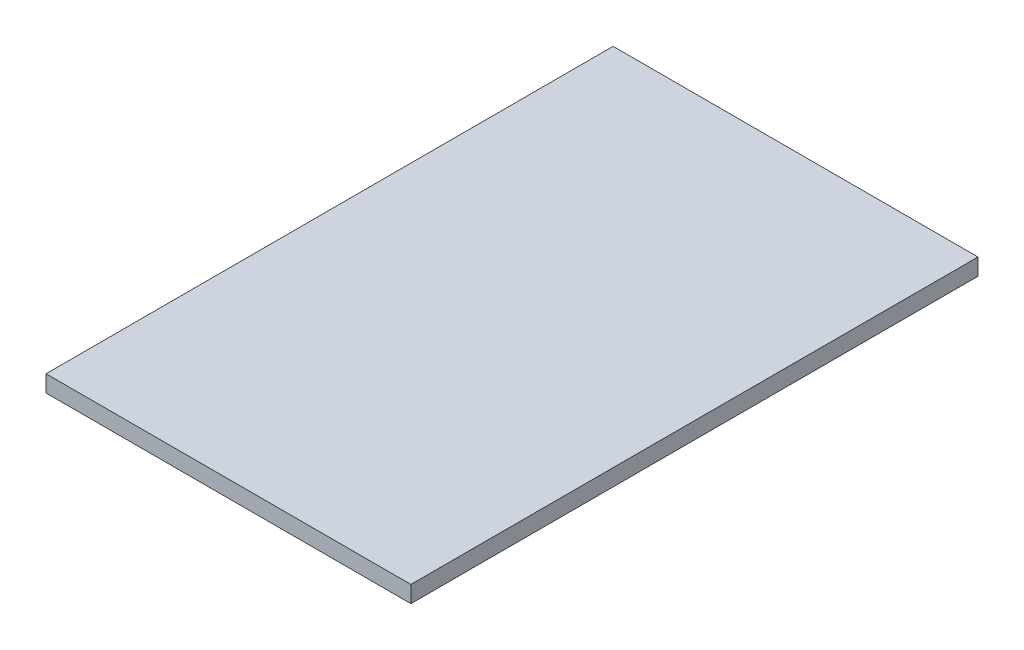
ISO-10303-21;
HEADER;
FILE_DESCRIPTION(('STEP AP214'),'2;1');
FILE_NAME('part.step','',(''),(''),'','','');
FILE_SCHEMA(('AUTOMOTIVE_DESIGN { 1 0 10303 214 1 1 1 1 }'));
ENDSEC;
DATA;
#1=APPLICATION_CONTEXT('core data for automotive mechanical design processes');
#2=APPLICATION_PROTOCOL_DEFINITION('international standard','automotive_design',2000,#1);
#3=PRODUCT_CONTEXT('',#1,'mechanical');
#4=PRODUCT('Part','Part','',(#3));
#5=PRODUCT_RELATED_PRODUCT_CATEGORY('part','',(#4));
#6=PRODUCT_DEFINITION_FORMATION('','',#4);
#7=PRODUCT_DEFINITION_CONTEXT('part definition',#1,'design');
#8=PRODUCT_DEFINITION('design','',#6,#7);
#9=PRODUCT_DEFINITION_SHAPE('','',#8);
#10=(LENGTH_UNIT() NAMED_UNIT(*) SI_UNIT(.MILLI.,.METRE.));
#11=(NAMED_UNIT(*) PLANE_ANGLE_UNIT() SI_UNIT($,.RADIAN.));
#12=(NAMED_UNIT(*) SI_UNIT($,.STERADIAN.) SOLID_ANGLE_UNIT());
#13=UNCERTAINTY_MEASURE_WITH_UNIT(LENGTH_MEASURE(1.E-05),#10,'distance_accuracy_value','');
#14=(GEOMETRIC_REPRESENTATION_CONTEXT(3) GLOBAL_UNCERTAINTY_ASSIGNED_CONTEXT((#13)) GLOBAL_UNIT_ASSIGNED_CONTEXT((#10,
#11,#12)) REPRESENTATION_CONTEXT('',''));
#15=CARTESIAN_POINT('',(0.,0.,0.));
#16=DIRECTION('',(0.,0.,1.));
#17=DIRECTION('',(1.,0.,0.));
#18=AXIS2_PLACEMENT_3D('',#15,#16,#17);
#19=CARTESIAN_POINT('',(0.,0.8,0.));
#20=DIRECTION('',(1.,0.,0.));
#21=DIRECTION('',(0.,0.,-1.));
#22=AXIS2_PLACEMENT_3D('',#19,#20,#21);
#23=PLANE('',#22);
#24=DIRECTION('',(0.,0.,1.));
#25=VECTOR('',#24,1.);
#26=CARTESIAN_POINT('',(0.,0.,0.));
#27=LINE('',#26,#25);
#28=CARTESIAN_POINT('',(0.,0.,-27.2));
#29=VERTEX_POINT('',#28);
#30=CARTESIAN_POINT('',(0.,0.,0.));
#31=VERTEX_POINT('',#30);
#32=EDGE_CURVE('E102',#29,#31,#27,.T.);
#33=ORIENTED_EDGE('',*,*,#32,.T.);
#34=DIRECTION('',(0.,-1.,0.));
#35=VECTOR('',#34,1.);
#36=CARTESIAN_POINT('',(0.,0.8,0.));
#37=LINE('',#36,#35);
#38=CARTESIAN_POINT('',(0.,0.8,0.));
#39=VERTEX_POINT('',#38);
#40=EDGE_CURVE('E11',#39,#31,#37,.T.);
#41=ORIENTED_EDGE('',*,*,#40,.F.);
#42=DIRECTION('',(0.,0.,1.));
#43=VECTOR('',#42,1.);
#44=CARTESIAN_POINT('',(0.,0.8,0.));
#45=LINE('',#44,#43);
#46=CARTESIAN_POINT('',(0.,0.8,-27.2));
#47=VERTEX_POINT('',#46);
#48=EDGE_CURVE('E90',#47,#39,#45,.T.);
#49=ORIENTED_EDGE('',*,*,#48,.F.);
#50=DIRECTION('',(0.,-1.,0.));
#51=VECTOR('',#50,1.);
#52=CARTESIAN_POINT('',(0.,0.8,-27.2));
#53=LINE('',#52,#51);
#54=EDGE_CURVE('E98',#47,#29,#53,.T.);
#55=ORIENTED_EDGE('',*,*,#54,.T.);
#56=EDGE_LOOP('',(#33,#41,#49,#55));
#57=FACE_BOUND('',#56,.T.);
#58=ADVANCED_FACE('F39',(#57),#23,.F.);
#59=CARTESIAN_POINT('',(0.,0.8,0.));
#60=DIRECTION('',(0.,0.,-1.));
#61=DIRECTION('',(-1.,0.,0.));
#62=AXIS2_PLACEMENT_3D('',#59,#60,#61);
#63=PLANE('',#62);
#64=DIRECTION('',(1.,0.,0.));
#65=VECTOR('',#64,1.);
#66=CARTESIAN_POINT('',(0.,0.,0.));
#67=LINE('',#66,#65);
#68=CARTESIAN_POINT('',(17.5,0.,0.));
#69=VERTEX_POINT('',#68);
#70=EDGE_CURVE('E94',#31,#69,#67,.T.);
#71=ORIENTED_EDGE('',*,*,#70,.T.);
#72=DIRECTION('',(0.,-1.,0.));
#73=VECTOR('',#72,1.);
#74=CARTESIAN_POINT('',(17.5,0.8,0.));
#75=LINE('',#74,#73);
#76=CARTESIAN_POINT('',(17.5,0.8,0.));
#77=VERTEX_POINT('',#76);
#78=EDGE_CURVE('E47',#77,#69,#75,.T.);
#79=ORIENTED_EDGE('',*,*,#78,.F.);
#80=DIRECTION('',(1.,0.,0.));
#81=VECTOR('',#80,1.);
#82=CARTESIAN_POINT('',(0.,0.8,0.));
#83=LINE('',#82,#81);
#84=EDGE_CURVE('E85',#39,#77,#83,.T.);
#85=ORIENTED_EDGE('',*,*,#84,.F.);
#86=ORIENTED_EDGE('',*,*,#40,.T.);
#87=EDGE_LOOP('',(#71,#79,#85,#86));
#88=FACE_BOUND('',#87,.T.);
#89=ADVANCED_FACE('F93',(#88),#63,.F.);
#90=CARTESIAN_POINT('',(17.5,0.8,0.));
#91=DIRECTION('',(-1.,0.,0.));
#92=DIRECTION('',(0.,0.,1.));
#93=AXIS2_PLACEMENT_3D('',#90,#91,#92);
#94=PLANE('',#93);
#95=DIRECTION('',(0.,0.,-1.));
#96=VECTOR('',#95,1.);
#97=CARTESIAN_POINT('',(17.5,0.,0.));
#98=LINE('',#97,#96);
#99=CARTESIAN_POINT('',(17.5,0.,-27.2));
#100=VERTEX_POINT('',#99);
#101=EDGE_CURVE('E72',#69,#100,#98,.T.);
#102=ORIENTED_EDGE('',*,*,#101,.T.);
#103=DIRECTION('',(0.,-1.,0.));
#104=VECTOR('',#103,1.);
#105=CARTESIAN_POINT('',(17.5,0.8,-27.2));
#106=LINE('',#105,#104);
#107=CARTESIAN_POINT('',(17.5,0.8,-27.2));
#108=VERTEX_POINT('',#107);
#109=EDGE_CURVE('E95',#108,#100,#106,.T.);
#110=ORIENTED_EDGE('',*,*,#109,.F.);
#111=DIRECTION('',(0.,0.,-1.));
#112=VECTOR('',#111,1.);
#113=CARTESIAN_POINT('',(17.5,0.8,0.));
#114=LINE('',#113,#112);
#115=EDGE_CURVE('E88',#77,#108,#114,.T.);
#116=ORIENTED_EDGE('',*,*,#115,.F.);
#117=ORIENTED_EDGE('',*,*,#78,.T.);
#118=EDGE_LOOP('',(#102,#110,#116,#117));
#119=FACE_BOUND('',#118,.T.);
#120=ADVANCED_FACE('F96',(#119),#94,.F.);
#121=CARTESIAN_POINT('',(0.,0.8,-27.2));
#122=DIRECTION('',(0.,0.,1.));
#123=DIRECTION('',(1.,0.,0.));
#124=AXIS2_PLACEMENT_3D('',#121,#122,#123);
#125=PLANE('',#124);
#126=DIRECTION('',(-1.,0.,0.));
#127=VECTOR('',#126,1.);
#128=CARTESIAN_POINT('',(0.,0.,-27.2));
#129=LINE('',#128,#127);
#130=EDGE_CURVE('E78',#100,#29,#129,.T.);
#131=ORIENTED_EDGE('',*,*,#130,.T.);
#132=ORIENTED_EDGE('',*,*,#54,.F.);
#133=DIRECTION('',(-1.,0.,0.));
#134=VECTOR('',#133,1.);
#135=CARTESIAN_POINT('',(0.,0.8,-27.2));
#136=LINE('',#135,#134);
#137=EDGE_CURVE('E55',#108,#47,#136,.T.);
#138=ORIENTED_EDGE('',*,*,#137,.F.);
#139=ORIENTED_EDGE('',*,*,#109,.T.);
#140=EDGE_LOOP('',(#131,#132,#138,#139));
#141=FACE_BOUND('',#140,.T.);
#142=ADVANCED_FACE('F109',(#141),#125,.F.);
#143=CARTESIAN_POINT('',(0.,0.8,0.));
#144=DIRECTION('',(0.,-1.,0.));
#145=DIRECTION('',(0.,0.,-1.));
#146=AXIS2_PLACEMENT_3D('',#143,#144,#145);
#147=PLANE('',#146);
#148=ORIENTED_EDGE('',*,*,#48,.T.);
#149=ORIENTED_EDGE('',*,*,#84,.T.);
#150=ORIENTED_EDGE('',*,*,#115,.T.);
#151=ORIENTED_EDGE('',*,*,#137,.T.);
#152=EDGE_LOOP('',(#148,#149,#150,#151));
#153=FACE_BOUND('',#152,.T.);
#154=ADVANCED_FACE('F86',(#153),#147,.F.);
#155=CARTESIAN_POINT('',(0.,0.,0.));
#156=DIRECTION('',(0.,-1.,0.));
#157=DIRECTION('',(0.,0.,-1.));
#158=AXIS2_PLACEMENT_3D('',#155,#156,#157);
#159=PLANE('',#158);
#160=ORIENTED_EDGE('',*,*,#32,.F.);
#161=ORIENTED_EDGE('',*,*,#130,.F.);
#162=ORIENTED_EDGE('',*,*,#101,.F.);
#163=ORIENTED_EDGE('',*,*,#70,.F.);
#164=EDGE_LOOP('',(#160,#161,#162,#163));
#165=FACE_BOUND('',#164,.T.);
#166=ADVANCED_FACE('F112',(#165),#159,.T.);
#167=CLOSED_SHELL('',(#58,#89,#120,#142,#154,#166));
#168=MANIFOLD_SOLID_BREP('B2',#167);
#169=ADVANCED_BREP_SHAPE_REPRESENTATION('',(#18,#168),#14);
#170=SHAPE_DEFINITION_REPRESENTATION(#9,#169);
ENDSEC;
END-ISO-10303-21;
